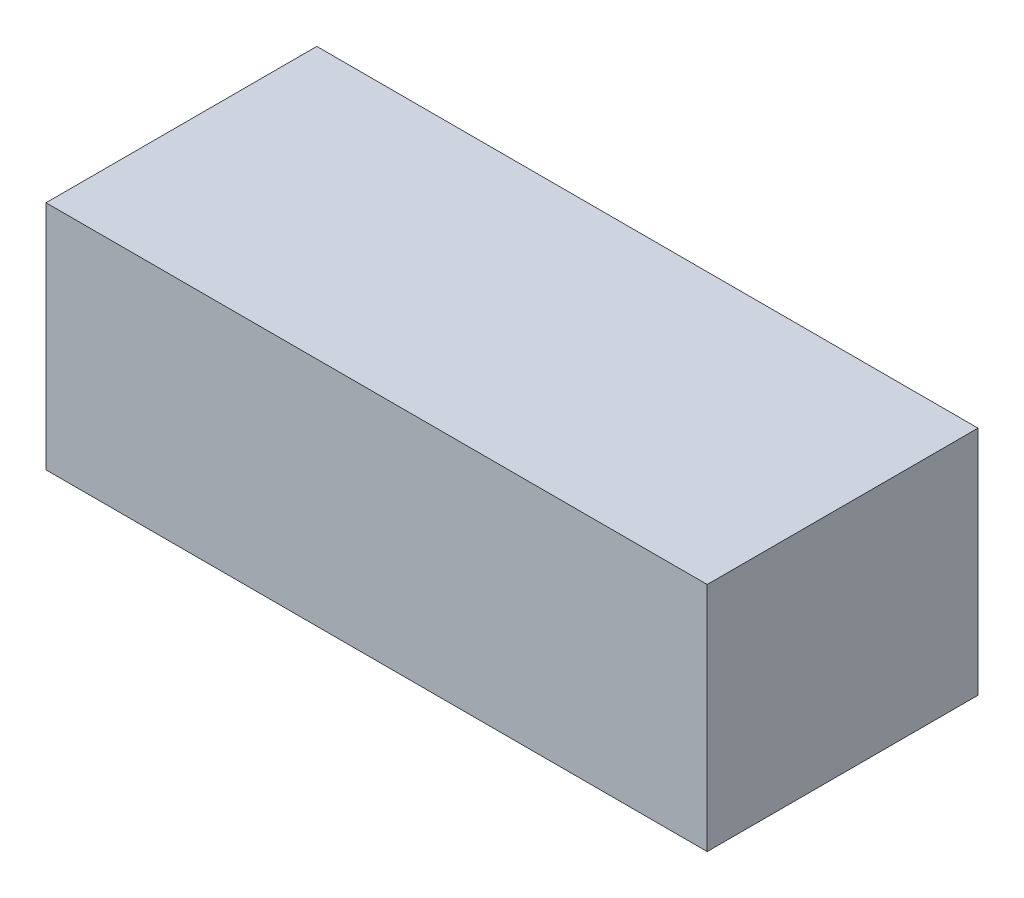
from build123d import *

# Parameters (mm, degrees)
SKIZZE1_W               = 92.605665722
SKIZZE1_H               = 37.92891628
LINEAR_AUSTRAGEN1_DEPTH = 32.4


with BuildPart() as part:
    # Skizze1 → Linear austragen1 (new body)
    with BuildSketch(Plane(origin=(0, 0, 0), x_dir=(1, 0, 0), z_dir=(0, 1, 0))):
        Rectangle(SKIZZE1_W, SKIZZE1_H)
    extrude(amount=LINEAR_AUSTRAGEN1_DEPTH)


solid = part.part
